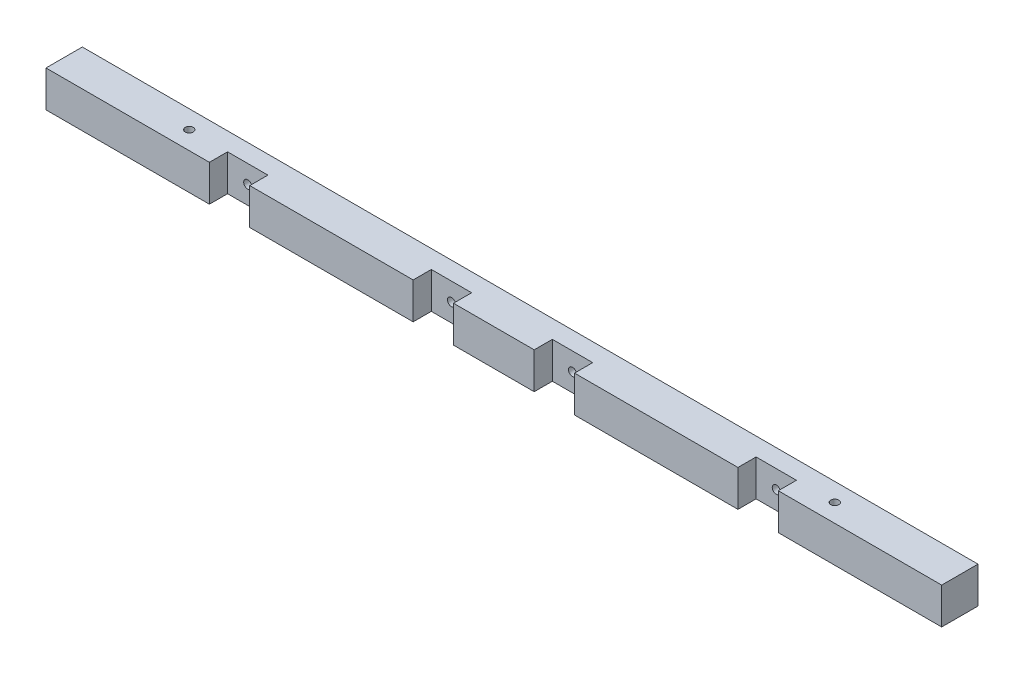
from build123d import *

# Parameters (mm, degrees)
ESQUISSE1_W              = 222
ESQUISSE1_H              = 9
EXTRUSION1_DEPTH         = 9
ESQUISSE2_W              = 10
ESQUISSE2_H              = 9
ENL_V_MAT_EXTRU_1_DEPTH  = 4.5
ESQUISSE3_R              = 1
ENL_V_MAT_EXTRU_2_DEPTH  = 4.5
ESQUISSE4_W              = 10
ESQUISSE4_H              = 9
ENL_V_MAT_EXTRU_3_DEPTH  = 4.5
ESQUISSE5_R              = 1
ENL_V_MAT_EXTRU_4_DEPTH  = 4.5
ESQUISSE6_W              = 10
ESQUISSE6_H              = 9
ENL_V_MAT_EXTRU_5_DEPTH  = 4.5
ESQUISSE7_R              = 1
ENL_V_MAT_EXTRU_6_DEPTH  = 4.5
ESQUISSE8_W              = 10
ESQUISSE8_H              = 9
ENL_V_MAT_EXTRU_7_DEPTH  = 4.5
ESQUISSE9_R              = 1
ENL_V_MAT_EXTRU_8_DEPTH  = 4.5
ESQUISSE10_R             = 1
ENL_V_MAT_EXTRU_9_DEPTH  = 9
ESQUISSE11_R             = 1
ENL_V_MAT_EXTRU_10_DEPTH = 9


with BuildPart() as part:
    # Esquisse1 → Extrusion1 (new body)
    with BuildSketch(Plane.XY):
        with Locations((111, 4.5)):
            Rectangle(ESQUISSE1_W, ESQUISSE1_H)
    extrude(amount=EXTRUSION1_DEPTH)

    # Esquisse2 → Enl_v. mat.-Extru.1 (cut)
    with BuildSketch(Plane.XY.offset(9)):
        with Locations((45.5, 4.5)):
            Rectangle(ESQUISSE2_W, ESQUISSE2_H)
    extrude(amount=-ENL_V_MAT_EXTRU_1_DEPTH, mode=Mode.SUBTRACT)

    # Esquisse3 → Enl_v. mat.-Extru.2 (cut)
    with BuildSketch(Plane.XY.offset(4.5)):
        with Locations((45.5, 4.5)):
            Circle(ESQUISSE3_R)
    extrude(amount=-ENL_V_MAT_EXTRU_2_DEPTH, mode=Mode.SUBTRACT)

    # Esquisse4 → Enl_v. mat.-Extru.3 (cut)
    with BuildSketch(Plane.XY.offset(9)):
        with Locations((96, 4.5)):
            Rectangle(ESQUISSE4_W, ESQUISSE4_H)
    extrude(amount=-ENL_V_MAT_EXTRU_3_DEPTH, mode=Mode.SUBTRACT)

    # Esquisse5 → Enl_v. mat.-Extru.4 (cut)
    with BuildSketch(Plane.XY.offset(4.5)):
        with Locations((96, 4.5)):
            Circle(ESQUISSE5_R)
    extrude(amount=-ENL_V_MAT_EXTRU_4_DEPTH, mode=Mode.SUBTRACT)

    # Esquisse6 → Enl_v. mat.-Extru.5 (cut)
    with BuildSketch(Plane.XY.offset(9)):
        with Locations((126, 4.5)):
            Rectangle(ESQUISSE6_W, ESQUISSE6_H)
    extrude(amount=-ENL_V_MAT_EXTRU_5_DEPTH, mode=Mode.SUBTRACT)

    # Esquisse7 → Enl_v. mat.-Extru.6 (cut)
    with BuildSketch(Plane.XY.offset(4.5)):
        with Locations((126, 4.5)):
            Circle(ESQUISSE7_R)
    extrude(amount=-ENL_V_MAT_EXTRU_6_DEPTH, mode=Mode.SUBTRACT)

    # Esquisse8 → Enl_v. mat.-Extru.7 (cut)
    with BuildSketch(Plane.XY.offset(9)):
        with Locations((176.5, 4.5)):
            Rectangle(ESQUISSE8_W, ESQUISSE8_H)
    extrude(amount=-ENL_V_MAT_EXTRU_7_DEPTH, mode=Mode.SUBTRACT)

    # Esquisse9 → Enl_v. mat.-Extru.8 (cut)
    with BuildSketch(Plane.XY.offset(4.5)):
        with Locations((176.5, 4.5)):
            Circle(ESQUISSE9_R)
    extrude(amount=-ENL_V_MAT_EXTRU_8_DEPTH, mode=Mode.SUBTRACT)

    # Esquisse10 → Enl_v. mat.-Extru.9 (cut)
    with BuildSketch(Plane(origin=(0, 9, 0), x_dir=(1, 0, 0), z_dir=(0, 1, 0))):
        with Locations(Location((31, -4.5, 0), (0, 0, 270))):
            Circle(ESQUISSE10_R)
    extrude(amount=-ENL_V_MAT_EXTRU_9_DEPTH, mode=Mode.SUBTRACT)

    # Esquisse11 → Enl_v. mat.-Extru.10 (cut)
    with BuildSketch(Plane(origin=(0, 9, 0), x_dir=(1, 0, 0), z_dir=(0, 1, 0))):
        with Locations(Location((191, -4.5, 0), (0, 0, 270))):
            Circle(ESQUISSE11_R)
    extrude(amount=-ENL_V_MAT_EXTRU_10_DEPTH, mode=Mode.SUBTRACT)


solid = part.part
